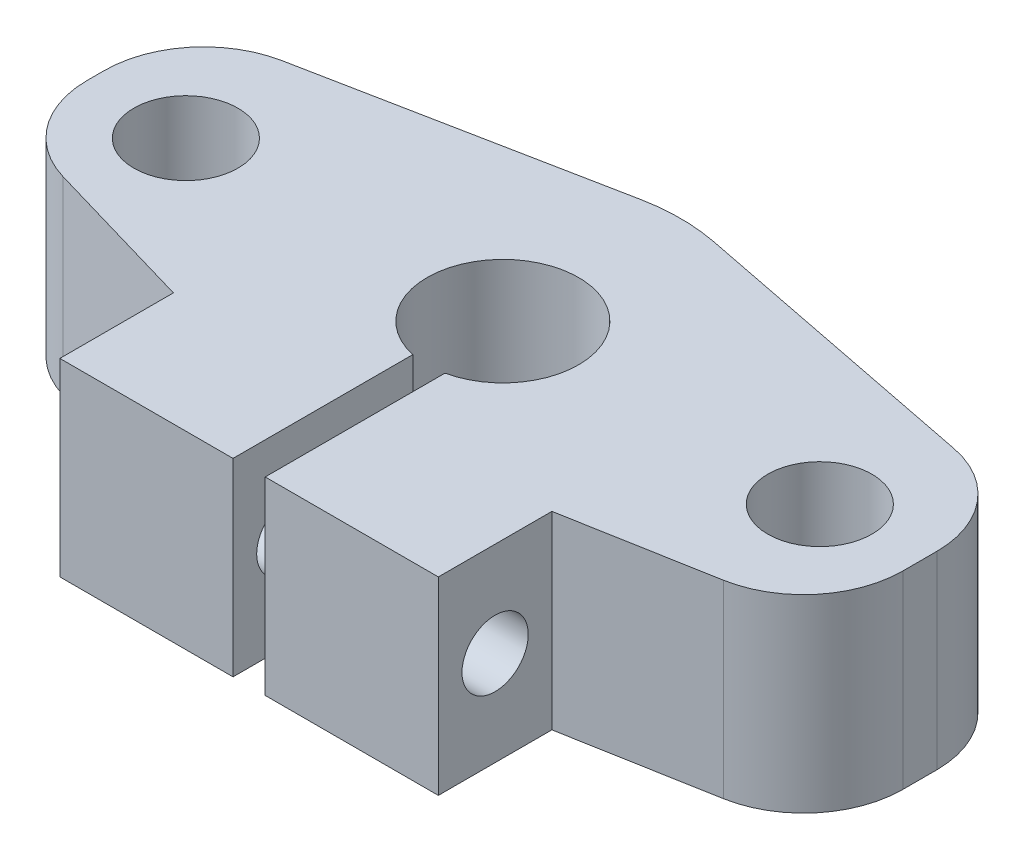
from build123d import *

# Parameters (mm, degrees)
SKIZZE1_R                       = 2.75
AUFSATZ_LINEAR_AUSTRAGEN1_DEPTH = 10
VERRUNDUNG1_R                   = 5.25
VERRUNDUNG2_R                   = 5.25
VERRUNDUNG3_R                   = 5.25
VERRUNDUNG4_R                   = 5.25
VERRUNDUNG5_R                   = 10
SKIZZE2_R                       = 1.75
SCHNITT_LINEAR_AUSTRAGEN1_DEPTH = 20


with BuildPart() as part:
    # Skizze1 → Aufsatz-Linear austragen1 (new body)
    with BuildSketch(Plane(origin=(0, 0, 0), x_dir=(1, 0, 0), z_dir=(0, 1, 0))):
        with BuildLine():
            Line((10, 0), (0.85, 0))
            Line((0.85, 0), (0.85, 9.5))
            ThreePointArc((0.85, 9.5), (0, 17.410396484), (-0.85, 9.5))
            Line((-0.85, 9.5), (-0.85, 0))
            Line((-0.85, 0), (-10, 0))
            Line((-10, 0), (-10, 6))
            Line((-10, 6), (-22, 9.5))
            Line((-22, 9.5), (-22, 18.659530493))
            Line((-22, 18.659530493), (0, 23))
            Line((0, 23), (22, 18.659530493))
            Line((22, 18.659530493), (22, 16.159530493))
            Line((22, 16.159530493), (22, 10.659530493))
            Line((22, 10.659530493), (22, 8.159530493))
            Line((22, 8.159530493), (10, 6))
            Line((10, 6), (10, 0))
        make_face()
        with Locations(Location((16.75, 13.409530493, 0), (0, 0, 270))):
            Circle(SKIZZE1_R, mode=Mode.SUBTRACT)
        with Locations(Location((-16.75, 13.409530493, 0), (0, 0, 270))):
            Circle(SKIZZE1_R, mode=Mode.SUBTRACT)
    extrude(amount=AUFSATZ_LINEAR_AUSTRAGEN1_DEPTH)

    # Verrundung1
    verrundung1_edges = [part.edges().sort_by_distance(p)[0] for p in [
        (-22, 5, -18.659530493),
    ]]
    fillet(verrundung1_edges, radius=VERRUNDUNG1_R)

    # Verrundung2
    verrundung2_edges = [part.edges().sort_by_distance(p)[0] for p in [
        (-22, 5, -9.5),
    ]]
    fillet(verrundung2_edges, radius=VERRUNDUNG2_R)

    # Verrundung3
    verrundung3_edges = [part.edges().sort_by_distance(p)[0] for p in [
        (22, 5, -8.159530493),
    ]]
    fillet(verrundung3_edges, radius=VERRUNDUNG3_R)

    # Verrundung4
    verrundung4_edges = [part.edges().sort_by_distance(p)[0] for p in [
        (22, 5, -18.659530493),
    ]]
    fillet(verrundung4_edges, radius=VERRUNDUNG4_R)

    # Verrundung5
    verrundung5_edges = [part.edges().sort_by_distance(p)[0] for p in [
        (0, 5, -23),
    ]]
    fillet(verrundung5_edges, radius=VERRUNDUNG5_R)

    # Skizze2 → Schnitt-Linear austragen1 (cut)
    with BuildSketch(Plane.ZY.offset(10)):
        with Locations((-3, 5)):
            Circle(SKIZZE2_R)
    extrude(amount=-SCHNITT_LINEAR_AUSTRAGEN1_DEPTH, mode=Mode.SUBTRACT)


solid = part.part
